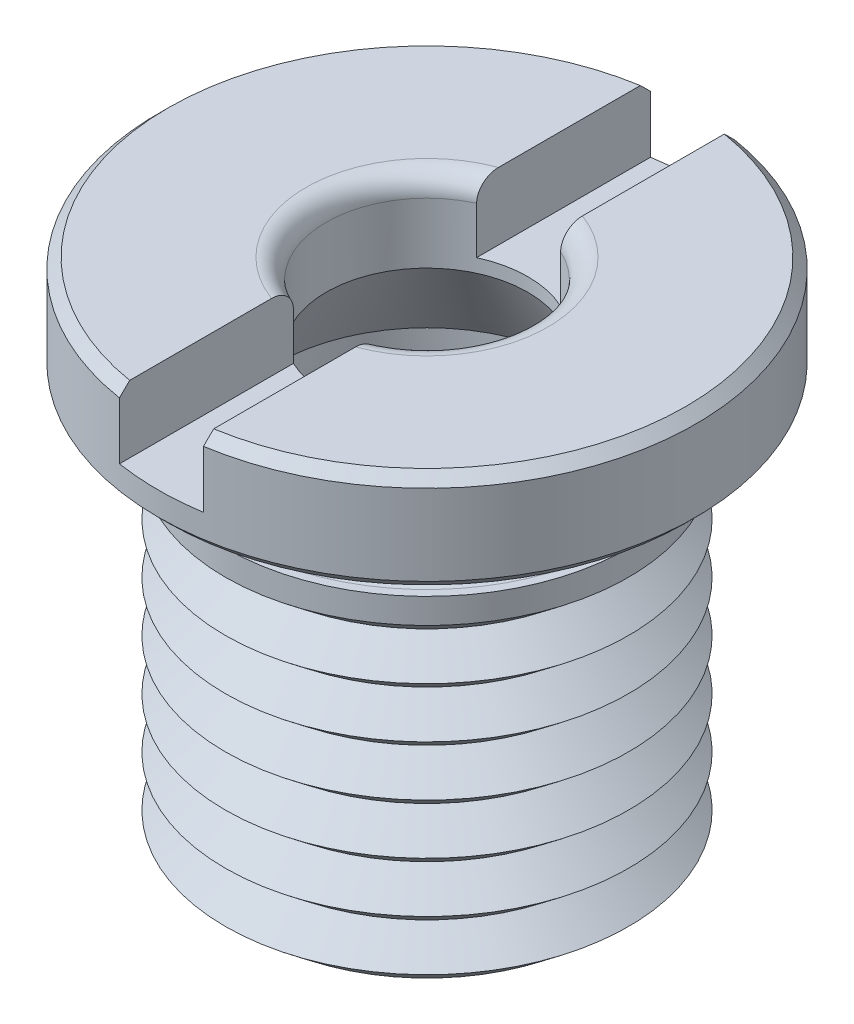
from build123d import *

# Parameters (mm, degrees)
SKETCH3_W       = 2.5
SKETCH3_H       = 16
EXTRUDE1_DEPTH  = 2
LPATTERN1_COUNT = 7
LPATTERN1_PITCH = 1.5


with BuildPart() as part:
    # Sketch1 → Revolve1 (revolve)
    with BuildSketch(Plane.XY, mode=Mode.PRIVATE) as revolve1_sk:
        with BuildLine():
            Line((4.5, 0), (6, 0))
            Line((6, 0), (6, 10.5))
            Line((6, 10.5), (5.75, 10.5))
            ThreePointArc((5.75, 10.5), (5.396446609, 10.646446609), (5.25, 11))
            Line((5.25, 11), (5.25, 11.5))
            ThreePointArc((5.25, 11.5), (5.396446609, 11.853553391), (5.75, 12))
            Line((5.75, 12), (7.7, 12))
            Line((7.7, 12), (8, 12.3))
            Line((8, 12.3), (8, 14.7))
            Line((8, 14.7), (7.7, 15))
            Line((7.7, 15), (3.6, 15))
            ThreePointArc((3.6, 15), (3.175735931, 14.824264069), (3, 14.4))
            Line((3, 14.4), (3, 12.598076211))
            Line((3, 12.598076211), (4.5, 10))
            Line((4.5, 10), (4.5, 0))
        make_face()
    revolve(revolve1_sk.sketch.rotate(Axis((0, 0, 0), (0, 1, 0)), 90), axis=Axis((0, 0, 0), (0, 1, 0)))

    # Sketch3 → Extrude1 (cut)
    with BuildSketch(Plane(origin=(0, 15, 0), x_dir=(1, 0, 0), z_dir=(0, 1, 0))):
        Rectangle(SKETCH3_W, SKETCH3_H)
    extrude(amount=-EXTRUDE1_DEPTH, mode=Mode.SUBTRACT)

    # Sketch2 → Cut-Revolve1 (revolve, cut)
    with BuildSketch(Plane.XY, mode=Mode.PRIVATE) as cut_revolve1_sk:
        Polygon((6, 0.75), (6, -0.75), (5.0632503, 0), align=None)
    cut_revolve1 = revolve(cut_revolve1_sk.sketch.rotate(Axis((0, 0, 0), (0, 1, 0)), 90), axis=Axis((0, 0, 0), (0, 1, 0)), mode=Mode.SUBTRACT)

    # LPattern1: Cut-Revolve1 ×7
    with Locations(*[(0, i * LPATTERN1_PITCH, 0) for i in range(1, LPATTERN1_COUNT)]):
        add(cut_revolve1, mode=Mode.SUBTRACT)


solid = part.part
